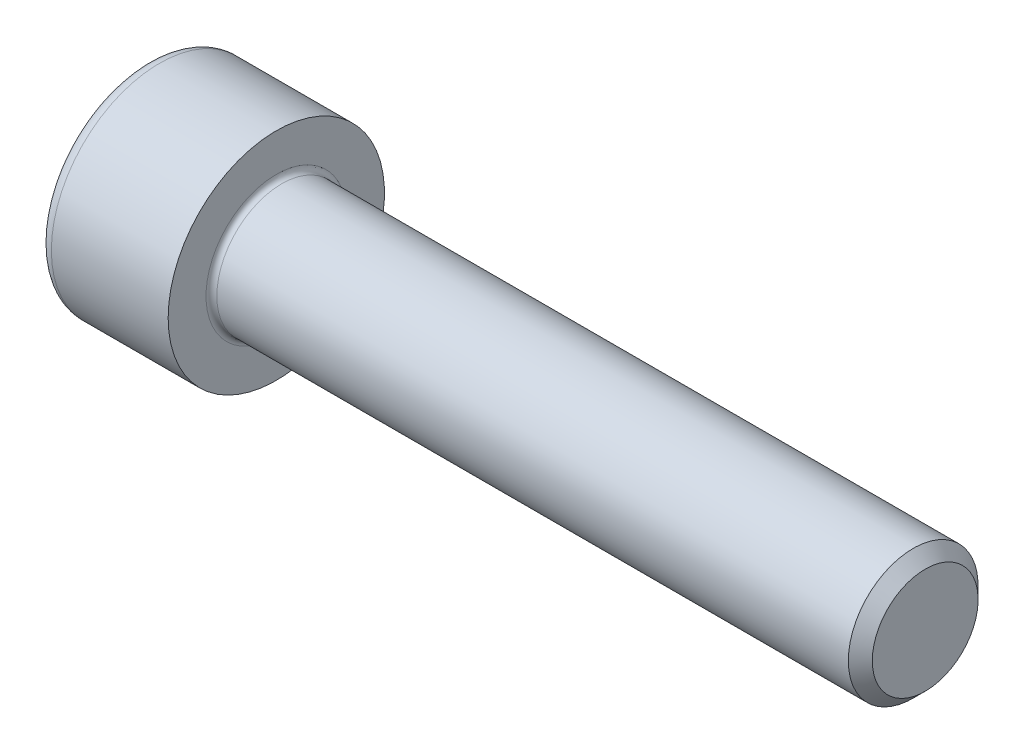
from build123d import *

# Parameters (mm, degrees)
FILLET1_R   = 0.25
FILLET2_R   = 0.6
HEX_2_DEPTH = 3


with BuildPart() as part:
    # BodySke → Base-Revolve (revolve)
    with BuildSketch(Plane.XY, mode=Mode.PRIVATE) as base_revolve_sk:
        Polygon((0, 0), (0, 5), (6, 5), (6, 3), (35.4455, 3), (36, 2.4455), (36, 0), align=None)
    revolve(base_revolve_sk.sketch.rotate(Axis((-31.75, 0, 0), (1, 0, 0)), 90), axis=Axis((-31.75, 0, 0), (1, 0, 0)))

    # Fillet1
    fillet1_edges = [part.edges().sort_by_distance(p)[0] for p in [
        (6, 0, -3),
    ]]
    fillet(fillet1_edges, radius=FILLET1_R)

    # Fillet2
    fillet2_edges = [part.edges().sort_by_distance(p)[0] for p in [
        (0, 0, -5),
    ]]
    fillet(fillet2_edges, radius=FILLET2_R)

    # Sketch2 → Hex-PreBroach (revolve, cut)
    with BuildSketch(Plane.XY, mode=Mode.PRIVATE) as hex_prebroach_sk:
        Polygon((0, 2.51), (3, 2.51), (4.449149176, 0), (0, 0), align=None)
    revolve(hex_prebroach_sk.sketch.rotate(Axis((0, 0, 0), (1, 0, 0)), 270), axis=Axis((0, 0, 0), (1, 0, 0)), mode=Mode.SUBTRACT)

    # Sketch3 → Hex 2 (cut)
    with BuildSketch(Plane(origin=(0, 0, 0), x_dir=(0, 0.500000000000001, 0.866025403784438), z_dir=(-1, 0, 0))):
        Polygon((1.449149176, 2.51), (-1.449149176, 2.51), (-2.898298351, 0), (-1.449149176, -2.51), (1.449149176, -2.51), (2.898298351, 0), align=None)
    extrude(amount=-HEX_2_DEPTH, mode=Mode.SUBTRACT)


solid = part.part
